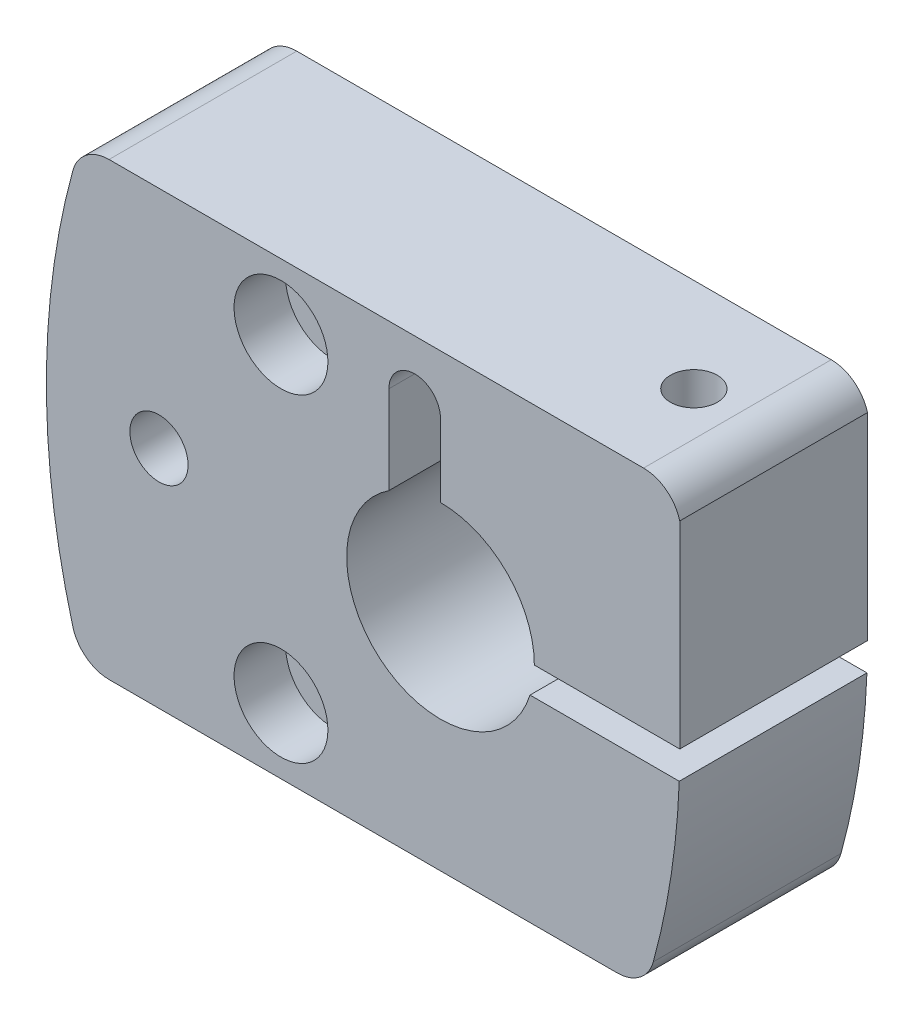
ISO-10303-21;
HEADER;
FILE_DESCRIPTION(('STEP AP214'),'2;1');
FILE_NAME('part.step','',(''),(''),'','','');
FILE_SCHEMA(('AUTOMOTIVE_DESIGN { 1 0 10303 214 1 1 1 1 }'));
ENDSEC;
DATA;
#1=APPLICATION_CONTEXT('core data for automotive mechanical design processes');
#2=APPLICATION_PROTOCOL_DEFINITION('international standard','automotive_design',2000,#1);
#3=PRODUCT_CONTEXT('',#1,'mechanical');
#4=PRODUCT('Part','Part','',(#3));
#5=PRODUCT_RELATED_PRODUCT_CATEGORY('part','',(#4));
#6=PRODUCT_DEFINITION_FORMATION('','',#4);
#7=PRODUCT_DEFINITION_CONTEXT('part definition',#1,'design');
#8=PRODUCT_DEFINITION('design','',#6,#7);
#9=PRODUCT_DEFINITION_SHAPE('','',#8);
#10=(LENGTH_UNIT() NAMED_UNIT(*) SI_UNIT(.MILLI.,.METRE.));
#11=(NAMED_UNIT(*) PLANE_ANGLE_UNIT() SI_UNIT($,.RADIAN.));
#12=(NAMED_UNIT(*) SI_UNIT($,.STERADIAN.) SOLID_ANGLE_UNIT());
#13=UNCERTAINTY_MEASURE_WITH_UNIT(LENGTH_MEASURE(1.E-05),#10,'distance_accuracy_value','');
#14=(GEOMETRIC_REPRESENTATION_CONTEXT(3) GLOBAL_UNCERTAINTY_ASSIGNED_CONTEXT((#13)) GLOBAL_UNIT_ASSIGNED_CONTEXT((#10,
#11,#12)) REPRESENTATION_CONTEXT('',''));
#15=CARTESIAN_POINT('',(0.,0.,0.));
#16=DIRECTION('',(0.,0.,1.));
#17=DIRECTION('',(1.,0.,0.));
#18=AXIS2_PLACEMENT_3D('',#15,#16,#17);
#19=CARTESIAN_POINT('',(19.5387056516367,-11.0000000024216,12.53));
#20=DIRECTION('',(1.23940943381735E-10,1.,0.));
#21=DIRECTION('',(0.,0.,-1.));
#22=AXIS2_PLACEMENT_3D('',#19,#20,#21);
#23=PLANE('',#22);
#24=CARTESIAN_POINT('',(16.9999999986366,-11.000000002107,10.));
#25=DIRECTION('',(1.23940943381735E-10,1.,0.));
#26=DIRECTION('',(0.,0.,-1.));
#27=AXIS2_PLACEMENT_3D('',#24,#25,#26);
#28=CIRCLE('',#27,2.5);
#29=CARTESIAN_POINT('',(16.9999999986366,-11.000000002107,7.5));
#30=VERTEX_POINT('',#29);
#31=EDGE_CURVE('E188',#30,#30,#28,.T.);
#32=ORIENTED_EDGE('',*,*,#31,.T.);
#33=EDGE_LOOP('',(#32));
#34=FACE_BOUND('',#33,.T.);
#35=ADVANCED_FACE('F14',(#34),#23,.T.);
#36=CARTESIAN_POINT('',(-16.999999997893,17.000000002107,14.5));
#37=DIRECTION('',(0.,0.,-1.));
#38=DIRECTION('',(-1.23940943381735E-10,-1.,0.));
#39=AXIS2_PLACEMENT_3D('',#36,#37,#38);
#40=CYLINDRICAL_SURFACE('',#39,2.75);
#41=CARTESIAN_POINT('',(-16.999999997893,17.000000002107,14.5));
#42=DIRECTION('',(0.,0.,-1.));
#43=DIRECTION('',(-1.23940943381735E-10,-1.,0.));
#44=AXIS2_PLACEMENT_3D('',#41,#42,#43);
#45=CIRCLE('',#44,2.75);
#46=CARTESIAN_POINT('',(-16.9999999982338,14.250000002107,14.5));
#47=VERTEX_POINT('',#46);
#48=EDGE_CURVE('E185',#47,#47,#45,.T.);
#49=ORIENTED_EDGE('',*,*,#48,.F.);
#50=EDGE_LOOP('',(#49));
#51=FACE_BOUND('',#50,.T.);
#52=CARTESIAN_POINT('',(-16.999999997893,17.000000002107,5.5));
#53=DIRECTION('',(0.,0.,-1.));
#54=DIRECTION('',(-1.23940943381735E-10,-1.,0.));
#55=AXIS2_PLACEMENT_3D('',#52,#53,#54);
#56=CIRCLE('',#55,2.75);
#57=CARTESIAN_POINT('',(-16.9999999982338,14.250000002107,5.5));
#58=VERTEX_POINT('',#57);
#59=EDGE_CURVE('E190',#58,#58,#56,.F.);
#60=ORIENTED_EDGE('',*,*,#59,.F.);
#61=EDGE_LOOP('',(#60));
#62=FACE_BOUND('',#61,.T.);
#63=ADVANCED_FACE('F202',(#51,#62),#40,.F.);
#64=CARTESIAN_POINT('',(-17.000000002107,-16.999999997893,14.5));
#65=DIRECTION('',(0.,0.,-1.));
#66=DIRECTION('',(-1.23940943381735E-10,-1.,0.));
#67=AXIS2_PLACEMENT_3D('',#64,#65,#66);
#68=CYLINDRICAL_SURFACE('',#67,2.75);
#69=CARTESIAN_POINT('',(-17.000000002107,-16.999999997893,14.5));
#70=DIRECTION('',(0.,0.,-1.));
#71=DIRECTION('',(-1.23940943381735E-10,-1.,0.));
#72=AXIS2_PLACEMENT_3D('',#69,#70,#71);
#73=CIRCLE('',#72,2.75);
#74=CARTESIAN_POINT('',(-17.0000000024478,-19.749999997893,14.5));
#75=VERTEX_POINT('',#74);
#76=EDGE_CURVE('E182',#75,#75,#73,.T.);
#77=ORIENTED_EDGE('',*,*,#76,.F.);
#78=EDGE_LOOP('',(#77));
#79=FACE_BOUND('',#78,.T.);
#80=CARTESIAN_POINT('',(-17.000000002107,-16.999999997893,5.5));
#81=DIRECTION('',(0.,0.,-1.));
#82=DIRECTION('',(-1.23940943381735E-10,-1.,0.));
#83=AXIS2_PLACEMENT_3D('',#80,#81,#82);
#84=CIRCLE('',#83,2.75);
#85=CARTESIAN_POINT('',(-17.0000000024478,-19.749999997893,5.5));
#86=VERTEX_POINT('',#85);
#87=EDGE_CURVE('E18',#86,#86,#84,.F.);
#88=ORIENTED_EDGE('',*,*,#87,.F.);
#89=EDGE_LOOP('',(#88));
#90=FACE_BOUND('',#89,.T.);
#91=ADVANCED_FACE('F200',(#79,#90),#68,.F.);
#92=CARTESIAN_POINT('',(-11.9225886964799,-11.9399999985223,5.5));
#93=DIRECTION('',(0.,0.,-1.));
#94=DIRECTION('',(-1.23940943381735E-10,-1.,0.));
#95=AXIS2_PLACEMENT_3D('',#92,#93,#94);
#96=PLANE('',#95);
#97=ORIENTED_EDGE('',*,*,#87,.T.);
#98=EDGE_LOOP('',(#97));
#99=FACE_BOUND('',#98,.T.);
#100=CARTESIAN_POINT('',(-17.000000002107,-16.999999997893,5.5));
#101=DIRECTION('',(0.,0.,-1.));
#102=DIRECTION('',(-1.23940943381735E-10,-1.,0.));
#103=AXIS2_PLACEMENT_3D('',#100,#101,#102);
#104=CIRCLE('',#103,5.);
#105=CARTESIAN_POINT('',(-17.0000000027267,-21.999999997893,5.5));
#106=VERTEX_POINT('',#105);
#107=EDGE_CURVE('E179',#106,#106,#104,.T.);
#108=ORIENTED_EDGE('',*,*,#107,.T.);
#109=EDGE_LOOP('',(#108));
#110=FACE_BOUND('',#109,.T.);
#111=ADVANCED_FACE('F197',(#99,#110),#96,.T.);
#112=CARTESIAN_POINT('',(-11.9225886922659,22.0600000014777,5.5));
#113=DIRECTION('',(0.,0.,-1.));
#114=DIRECTION('',(-1.23940943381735E-10,-1.,0.));
#115=AXIS2_PLACEMENT_3D('',#112,#113,#114);
#116=PLANE('',#115);
#117=ORIENTED_EDGE('',*,*,#59,.T.);
#118=EDGE_LOOP('',(#117));
#119=FACE_BOUND('',#118,.T.);
#120=CARTESIAN_POINT('',(-16.999999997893,17.000000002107,5.5));
#121=DIRECTION('',(0.,0.,-1.));
#122=DIRECTION('',(-1.23940943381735E-10,-1.,0.));
#123=AXIS2_PLACEMENT_3D('',#120,#121,#122);
#124=CIRCLE('',#123,5.);
#125=CARTESIAN_POINT('',(-16.9999999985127,12.000000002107,5.5));
#126=VERTEX_POINT('',#125);
#127=EDGE_CURVE('E176',#126,#126,#124,.T.);
#128=ORIENTED_EDGE('',*,*,#127,.T.);
#129=EDGE_LOOP('',(#128));
#130=FACE_BOUND('',#129,.T.);
#131=ADVANCED_FACE('F211',(#119,#130),#116,.T.);
#132=CARTESIAN_POINT('',(16.9999999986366,-11.000000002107,10.));
#133=DIRECTION('',(1.23940943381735E-10,1.,0.));
#134=DIRECTION('',(0.,0.,-1.));
#135=AXIS2_PLACEMENT_3D('',#132,#133,#134);
#136=CYLINDRICAL_SURFACE('',#135,2.5);
#137=CARTESIAN_POINT('',(16.9999999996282,-3.000000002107,10.));
#138=DIRECTION('',(1.23940943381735E-10,1.,0.));
#139=DIRECTION('',(0.,0.,-1.));
#140=AXIS2_PLACEMENT_3D('',#137,#138,#139);
#141=CIRCLE('',#140,2.5);
#142=CARTESIAN_POINT('',(16.9999999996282,-3.000000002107,7.5));
#143=VERTEX_POINT('',#142);
#144=EDGE_CURVE('E167',#143,#143,#141,.T.);
#145=ORIENTED_EDGE('',*,*,#144,.T.);
#146=EDGE_LOOP('',(#145));
#147=FACE_BOUND('',#146,.T.);
#148=ORIENTED_EDGE('',*,*,#31,.F.);
#149=EDGE_LOOP('',(#148));
#150=FACE_BOUND('',#149,.T.);
#151=ADVANCED_FACE('F235',(#147,#150),#136,.F.);
#152=CARTESIAN_POINT('',(17.,-2.10699860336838E-09,10.));
#153=DIRECTION('',(1.23940943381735E-10,1.,0.));
#154=DIRECTION('',(0.,0.,-1.));
#155=AXIS2_PLACEMENT_3D('',#152,#153,#154);
#156=CYLINDRICAL_SURFACE('',#155,2.5);
#157=CARTESIAN_POINT('',(17.,-2.10699860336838E-09,10.));
#158=DIRECTION('',(1.23940943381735E-10,1.,0.));
#159=DIRECTION('',(0.,0.,-1.));
#160=AXIS2_PLACEMENT_3D('',#157,#158,#159);
#161=CIRCLE('',#160,2.5);
#162=CARTESIAN_POINT('',(17.,-2.10699860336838E-09,7.5));
#163=VERTEX_POINT('',#162);
#164=EDGE_CURVE('E162',#163,#163,#161,.F.);
#165=ORIENTED_EDGE('',*,*,#164,.T.);
#166=EDGE_LOOP('',(#165));
#167=FACE_BOUND('',#166,.T.);
#168=CARTESIAN_POINT('',(17.0000000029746,23.999999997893,10.));
#169=DIRECTION('',(1.23940943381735E-10,1.,0.));
#170=DIRECTION('',(0.,0.,-1.));
#171=AXIS2_PLACEMENT_3D('',#168,#169,#170);
#172=CIRCLE('',#171,2.5);
#173=CARTESIAN_POINT('',(17.0000000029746,23.999999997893,7.5));
#174=VERTEX_POINT('',#173);
#175=EDGE_CURVE('E172',#174,#174,#172,.T.);
#176=ORIENTED_EDGE('',*,*,#175,.T.);
#177=EDGE_LOOP('',(#176));
#178=FACE_BOUND('',#177,.T.);
#179=ADVANCED_FACE('F240',(#167,#178),#156,.F.);
#180=CARTESIAN_POINT('',(-11.9225886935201,11.9400000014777,14.5));
#181=DIRECTION('',(0.,0.,1.));
#182=DIRECTION('',(1.23940943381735E-10,1.,0.));
#183=AXIS2_PLACEMENT_3D('',#180,#181,#182);
#184=PLANE('',#183);
#185=ORIENTED_EDGE('',*,*,#48,.T.);
#186=EDGE_LOOP('',(#185));
#187=FACE_BOUND('',#186,.T.);
#188=CARTESIAN_POINT('',(-16.999999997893,17.000000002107,14.5));
#189=DIRECTION('',(0.,0.,1.));
#190=DIRECTION('',(1.23940943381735E-10,1.,0.));
#191=AXIS2_PLACEMENT_3D('',#188,#189,#190);
#192=CIRCLE('',#191,5.);
#193=CARTESIAN_POINT('',(-16.9999999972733,22.000000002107,14.5));
#194=VERTEX_POINT('',#193);
#195=EDGE_CURVE('E158',#194,#194,#192,.T.);
#196=ORIENTED_EDGE('',*,*,#195,.T.);
#197=EDGE_LOOP('',(#196));
#198=FACE_BOUND('',#197,.T.);
#199=ADVANCED_FACE('F236',(#187,#198),#184,.T.);
#200=CARTESIAN_POINT('',(-11.9225886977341,-22.0599999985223,14.5));
#201=DIRECTION('',(0.,0.,1.));
#202=DIRECTION('',(1.23940943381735E-10,1.,0.));
#203=AXIS2_PLACEMENT_3D('',#200,#201,#202);
#204=PLANE('',#203);
#205=ORIENTED_EDGE('',*,*,#76,.T.);
#206=EDGE_LOOP('',(#205));
#207=FACE_BOUND('',#206,.T.);
#208=CARTESIAN_POINT('',(-17.000000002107,-16.999999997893,14.5));
#209=DIRECTION('',(0.,0.,1.));
#210=DIRECTION('',(1.23940943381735E-10,1.,0.));
#211=AXIS2_PLACEMENT_3D('',#208,#209,#210);
#212=CIRCLE('',#211,5.);
#213=CARTESIAN_POINT('',(-17.0000000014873,-11.999999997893,14.5));
#214=VERTEX_POINT('',#213);
#215=EDGE_CURVE('E155',#214,#214,#212,.T.);
#216=ORIENTED_EDGE('',*,*,#215,.T.);
#217=EDGE_LOOP('',(#216));
#218=FACE_BOUND('',#217,.T.);
#219=ADVANCED_FACE('F239',(#207,#218),#204,.T.);
#220=CARTESIAN_POINT('',(-17.000000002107,-16.999999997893,5.5));
#221=DIRECTION('',(0.,0.,-1.));
#222=DIRECTION('',(-1.23940943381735E-10,-1.,0.));
#223=AXIS2_PLACEMENT_3D('',#220,#221,#222);
#224=CYLINDRICAL_SURFACE('',#223,5.);
#225=ORIENTED_EDGE('',*,*,#107,.F.);
#226=EDGE_LOOP('',(#225));
#227=FACE_BOUND('',#226,.T.);
#228=CARTESIAN_POINT('',(-17.000000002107,-16.999999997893,0.));
#229=DIRECTION('',(0.,0.,-1.));
#230=DIRECTION('',(-1.23940943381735E-10,-1.,0.));
#231=AXIS2_PLACEMENT_3D('',#228,#229,#230);
#232=CIRCLE('',#231,5.);
#233=CARTESIAN_POINT('',(-17.0000000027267,-21.999999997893,0.));
#234=VERTEX_POINT('',#233);
#235=EDGE_CURVE('E295',#234,#234,#232,.T.);
#236=ORIENTED_EDGE('',*,*,#235,.T.);
#237=EDGE_LOOP('',(#236));
#238=FACE_BOUND('',#237,.T.);
#239=ADVANCED_FACE('F244',(#227,#238),#224,.F.);
#240=CARTESIAN_POINT('',(-16.999999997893,17.000000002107,5.5));
#241=DIRECTION('',(0.,0.,-1.));
#242=DIRECTION('',(-1.23940943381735E-10,-1.,0.));
#243=AXIS2_PLACEMENT_3D('',#240,#241,#242);
#244=CYLINDRICAL_SURFACE('',#243,5.);
#245=ORIENTED_EDGE('',*,*,#127,.F.);
#246=EDGE_LOOP('',(#245));
#247=FACE_BOUND('',#246,.T.);
#248=CARTESIAN_POINT('',(-16.999999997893,17.000000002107,0.));
#249=DIRECTION('',(0.,0.,-1.));
#250=DIRECTION('',(-1.23940943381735E-10,-1.,0.));
#251=AXIS2_PLACEMENT_3D('',#248,#249,#250);
#252=CIRCLE('',#251,5.);
#253=CARTESIAN_POINT('',(-16.9999999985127,12.000000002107,0.));
#254=VERTEX_POINT('',#253);
#255=EDGE_CURVE('E292',#254,#254,#252,.T.);
#256=ORIENTED_EDGE('',*,*,#255,.T.);
#257=EDGE_LOOP('',(#256));
#258=FACE_BOUND('',#257,.T.);
#259=ADVANCED_FACE('F584',(#247,#258),#244,.F.);
#260=CARTESIAN_POINT('',(21.6409888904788,19.9999999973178,20.));
#261=DIRECTION('',(0.,0.,-1.));
#262=DIRECTION('',(-1.23940943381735E-10,-1.,0.));
#263=AXIS2_PLACEMENT_3D('',#260,#261,#262);
#264=CYLINDRICAL_SURFACE('',#263,4.);
#265=CARTESIAN_POINT('',(21.6409888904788,19.9999999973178,20.));
#266=DIRECTION('',(0.,0.,-1.));
#267=DIRECTION('',(-1.23940943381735E-10,-1.,0.));
#268=AXIS2_PLACEMENT_3D('',#265,#266,#267);
#269=CIRCLE('',#268,4.);
#270=CARTESIAN_POINT('',(25.5000000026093,21.0526315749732,20.));
#271=VERTEX_POINT('',#270);
#272=CARTESIAN_POINT('',(21.6409888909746,23.9999999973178,20.));
#273=VERTEX_POINT('',#272);
#274=EDGE_CURVE('E357',#271,#273,#269,.F.);
#275=ORIENTED_EDGE('',*,*,#274,.F.);
#276=DIRECTION('',(0.,0.,-1.));
#277=VECTOR('',#276,1.);
#278=CARTESIAN_POINT('',(25.5000000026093,21.0526315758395,10.));
#279=LINE('',#278,#277);
#280=CARTESIAN_POINT('',(25.5000000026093,21.0526315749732,0.));
#281=VERTEX_POINT('',#280);
#282=EDGE_CURVE('E161',#271,#281,#279,.T.);
#283=ORIENTED_EDGE('',*,*,#282,.T.);
#284=CARTESIAN_POINT('',(21.6409888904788,19.9999999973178,0.));
#285=DIRECTION('',(0.,0.,-1.));
#286=DIRECTION('',(-1.23940943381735E-10,-1.,0.));
#287=AXIS2_PLACEMENT_3D('',#284,#285,#286);
#288=CIRCLE('',#287,4.);
#289=CARTESIAN_POINT('',(21.6409888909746,23.9999999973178,0.));
#290=VERTEX_POINT('',#289);
#291=EDGE_CURVE('E297',#281,#290,#288,.F.);
#292=ORIENTED_EDGE('',*,*,#291,.T.);
#293=DIRECTION('',(0.,0.,1.));
#294=VECTOR('',#293,1.);
#295=CARTESIAN_POINT('',(21.6409888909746,23.9999999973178,10.));
#296=LINE('',#295,#294);
#297=EDGE_CURVE('E175',#290,#273,#296,.T.);
#298=ORIENTED_EDGE('',*,*,#297,.T.);
#299=EDGE_LOOP('',(#275,#283,#292,#298));
#300=FACE_BOUND('',#299,.T.);
#301=ADVANCED_FACE('F249',(#300),#264,.T.);
#302=CARTESIAN_POINT('',(21.6409888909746,23.9999999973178,0.));
#303=DIRECTION('',(-1.23940943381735E-10,-1.,0.));
#304=DIRECTION('',(0.,0.,1.));
#305=AXIS2_PLACEMENT_3D('',#302,#303,#304);
#306=PLANE('',#305);
#307=ORIENTED_EDGE('',*,*,#175,.F.);
#308=EDGE_LOOP('',(#307));
#309=FACE_BOUND('',#308,.T.);
#310=DIRECTION('',(0.,0.,-1.));
#311=VECTOR('',#310,1.);
#312=CARTESIAN_POINT('',(-35.3212111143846,24.0000000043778,10.));
#313=LINE('',#312,#311);
#314=CARTESIAN_POINT('',(-35.321211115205,24.0000000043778,20.));
#315=VERTEX_POINT('',#314);
#316=CARTESIAN_POINT('',(-35.321211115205,24.0000000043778,0.));
#317=VERTEX_POINT('',#316);
#318=EDGE_CURVE('E123',#315,#317,#313,.T.);
#319=ORIENTED_EDGE('',*,*,#318,.F.);
#320=DIRECTION('',(-1.,1.23940943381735E-10,0.));
#321=VECTOR('',#320,1.);
#322=CARTESIAN_POINT('',(-8.80382733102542,24.0000000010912,20.));
#323=LINE('',#322,#321);
#324=EDGE_CURVE('E354',#273,#315,#323,.T.);
#325=ORIENTED_EDGE('',*,*,#324,.F.);
#326=ORIENTED_EDGE('',*,*,#297,.F.);
#327=DIRECTION('',(-1.,1.23940943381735E-10,0.));
#328=VECTOR('',#327,1.);
#329=CARTESIAN_POINT('',(-8.80382733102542,24.0000000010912,0.));
#330=LINE('',#329,#328);
#331=EDGE_CURVE('E149',#290,#317,#330,.T.);
#332=ORIENTED_EDGE('',*,*,#331,.T.);
#333=EDGE_LOOP('',(#319,#325,#326,#332));
#334=FACE_BOUND('',#333,.T.);
#335=ADVANCED_FACE('F246',(#309,#334),#306,.F.);
#336=CARTESIAN_POINT('',(-35.3212111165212,20.0000000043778,20.));
#337=DIRECTION('',(0.,0.,-1.));
#338=DIRECTION('',(-1.23940943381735E-10,-1.,0.));
#339=AXIS2_PLACEMENT_3D('',#336,#337,#338);
#340=CYLINDRICAL_SURFACE('',#339,4.);
#341=CARTESIAN_POINT('',(-35.3212111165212,20.0000000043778,20.));
#342=DIRECTION('',(0.,0.,-1.));
#343=DIRECTION('',(-1.23940943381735E-10,-1.,0.));
#344=AXIS2_PLACEMENT_3D('',#341,#342,#343);
#345=CIRCLE('',#344,4.);
#346=CARTESIAN_POINT('',(-39.1802222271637,21.0526315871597,20.));
#347=VERTEX_POINT('',#346);
#348=EDGE_CURVE('E356',#315,#347,#345,.F.);
#349=ORIENTED_EDGE('',*,*,#348,.F.);
#350=ORIENTED_EDGE('',*,*,#318,.T.);
#351=CARTESIAN_POINT('',(-35.3212111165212,20.0000000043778,0.));
#352=DIRECTION('',(0.,0.,-1.));
#353=DIRECTION('',(-1.23940943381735E-10,-1.,0.));
#354=AXIS2_PLACEMENT_3D('',#351,#352,#353);
#355=CIRCLE('',#354,4.);
#356=CARTESIAN_POINT('',(-39.1802222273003,21.0526315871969,0.));
#357=VERTEX_POINT('',#356);
#358=EDGE_CURVE('E142',#317,#357,#355,.F.);
#359=ORIENTED_EDGE('',*,*,#358,.T.);
#360=DIRECTION('',(0.,0.,-1.));
#361=VECTOR('',#360,1.);
#362=CARTESIAN_POINT('',(-39.180222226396,21.052631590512,10.));
#363=LINE('',#362,#361);
#364=EDGE_CURVE('E130',#347,#357,#363,.T.);
#365=ORIENTED_EDGE('',*,*,#364,.F.);
#366=EDGE_LOOP('',(#349,#350,#359,#365));
#367=FACE_BOUND('',#366,.T.);
#368=ADVANCED_FACE('F148',(#367),#340,.T.);
#369=CARTESIAN_POINT('',(38.,-4.70974995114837E-09,20.));
#370=DIRECTION('',(0.,0.,-1.));
#371=DIRECTION('',(-1.23940943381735E-10,-1.,0.));
#372=AXIS2_PLACEMENT_3D('',#369,#370,#371);
#373=CYLINDRICAL_SURFACE('',#372,80.);
#374=CARTESIAN_POINT('',(38.,-4.70974995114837E-09,20.));
#375=DIRECTION('',(0.,0.,-1.));
#376=DIRECTION('',(-1.23940943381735E-10,-1.,0.));
#377=AXIS2_PLACEMENT_3D('',#374,#375,#376);
#378=CIRCLE('',#377,80.);
#379=CARTESIAN_POINT('',(-39.1802222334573,-21.0526315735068,20.));
#380=VERTEX_POINT('',#379);
#381=EDGE_CURVE('E135',#347,#380,#378,.F.);
#382=ORIENTED_EDGE('',*,*,#381,.F.);
#383=ORIENTED_EDGE('',*,*,#364,.T.);
#384=CARTESIAN_POINT('',(38.,-4.70974995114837E-09,0.));
#385=DIRECTION('',(0.,0.,-1.));
#386=DIRECTION('',(-1.23940943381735E-10,-1.,0.));
#387=AXIS2_PLACEMENT_3D('',#384,#385,#386);
#388=CIRCLE('',#387,80.);
#389=CARTESIAN_POINT('',(-39.1802222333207,-21.0526315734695,0.));
#390=VERTEX_POINT('',#389);
#391=EDGE_CURVE('E134',#357,#390,#388,.F.);
#392=ORIENTED_EDGE('',*,*,#391,.T.);
#393=DIRECTION('',(0.,0.,-1.));
#394=VECTOR('',#393,1.);
#395=CARTESIAN_POINT('',(-39.1802222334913,-21.0526315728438,10.));
#396=LINE('',#395,#394);
#397=EDGE_CURVE('E136',#380,#390,#396,.T.);
#398=ORIENTED_EDGE('',*,*,#397,.F.);
#399=EDGE_LOOP('',(#382,#383,#392,#398));
#400=FACE_BOUND('',#399,.T.);
#401=ADVANCED_FACE('F132',(#400),#373,.T.);
#402=CARTESIAN_POINT('',(-35.3212111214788,-19.9999999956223,20.));
#403=DIRECTION('',(0.,0.,-1.));
#404=DIRECTION('',(-1.23940943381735E-10,-1.,0.));
#405=AXIS2_PLACEMENT_3D('',#402,#403,#404);
#406=CYLINDRICAL_SURFACE('',#405,4.);
#407=CARTESIAN_POINT('',(-35.3212111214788,-19.9999999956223,20.));
#408=DIRECTION('',(0.,0.,-1.));
#409=DIRECTION('',(-1.23940943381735E-10,-1.,0.));
#410=AXIS2_PLACEMENT_3D('',#407,#408,#409);
#411=CIRCLE('',#410,4.);
#412=CARTESIAN_POINT('',(-35.3212111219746,-23.9999999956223,20.));
#413=VERTEX_POINT('',#412);
#414=EDGE_CURVE('E353',#380,#413,#411,.F.);
#415=ORIENTED_EDGE('',*,*,#414,.F.);
#416=ORIENTED_EDGE('',*,*,#397,.T.);
#417=CARTESIAN_POINT('',(-35.3212111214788,-19.9999999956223,0.));
#418=DIRECTION('',(0.,0.,-1.));
#419=DIRECTION('',(-1.23940943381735E-10,-1.,0.));
#420=AXIS2_PLACEMENT_3D('',#417,#418,#419);
#421=CIRCLE('',#420,4.);
#422=CARTESIAN_POINT('',(-35.3212111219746,-23.9999999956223,0.));
#423=VERTEX_POINT('',#422);
#424=EDGE_CURVE('E146',#390,#423,#421,.F.);
#425=ORIENTED_EDGE('',*,*,#424,.T.);
#426=DIRECTION('',(0.,0.,1.));
#427=VECTOR('',#426,1.);
#428=CARTESIAN_POINT('',(-35.3212111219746,-23.9999999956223,10.));
#429=LINE('',#428,#427);
#430=EDGE_CURVE('E384',#423,#413,#429,.T.);
#431=ORIENTED_EDGE('',*,*,#430,.T.);
#432=EDGE_LOOP('',(#415,#416,#425,#431));
#433=FACE_BOUND('',#432,.T.);
#434=ADVANCED_FACE('F255',(#433),#406,.T.);
#435=CARTESIAN_POINT('',(18.8212111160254,-24.0000000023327,20.));
#436=DIRECTION('',(1.23940943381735E-10,1.,0.));
#437=DIRECTION('',(0.,0.,-1.));
#438=AXIS2_PLACEMENT_3D('',#435,#436,#437);
#439=PLANE('',#438);
#440=DIRECTION('',(0.,0.,-1.));
#441=VECTOR('',#440,1.);
#442=CARTESIAN_POINT('',(18.8212111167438,-24.0000000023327,10.));
#443=LINE('',#442,#441);
#444=CARTESIAN_POINT('',(18.8212111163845,-24.0000000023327,20.));
#445=VERTEX_POINT('',#444);
#446=CARTESIAN_POINT('',(18.8212111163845,-24.0000000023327,0.));
#447=VERTEX_POINT('',#446);
#448=EDGE_CURVE('E382',#445,#447,#443,.T.);
#449=ORIENTED_EDGE('',*,*,#448,.F.);
#450=DIRECTION('',(1.,-1.23940943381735E-10,0.));
#451=VECTOR('',#450,1.);
#452=CARTESIAN_POINT('',(-8.80382733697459,-23.9999999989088,20.));
#453=LINE('',#452,#451);
#454=EDGE_CURVE('E350',#413,#445,#453,.T.);
#455=ORIENTED_EDGE('',*,*,#454,.F.);
#456=ORIENTED_EDGE('',*,*,#430,.F.);
#457=DIRECTION('',(1.,-1.23940943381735E-10,0.));
#458=VECTOR('',#457,1.);
#459=CARTESIAN_POINT('',(-8.80382733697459,-23.9999999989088,0.));
#460=LINE('',#459,#458);
#461=EDGE_CURVE('E319',#423,#447,#460,.T.);
#462=ORIENTED_EDGE('',*,*,#461,.T.);
#463=EDGE_LOOP('',(#449,#455,#456,#462));
#464=FACE_BOUND('',#463,.T.);
#465=ADVANCED_FACE('F251',(#464),#439,.F.);
#466=CARTESIAN_POINT('',(18.8212111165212,-20.0000000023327,20.));
#467=DIRECTION('',(0.,0.,-1.));
#468=DIRECTION('',(-1.23940943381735E-10,-1.,0.));
#469=AXIS2_PLACEMENT_3D('',#466,#467,#468);
#470=CYLINDRICAL_SURFACE('',#469,4.);
#471=CARTESIAN_POINT('',(18.8212111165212,-20.0000000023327,20.));
#472=DIRECTION('',(0.,0.,-1.));
#473=DIRECTION('',(-1.23940943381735E-10,-1.,0.));
#474=AXIS2_PLACEMENT_3D('',#471,#472,#473);
#475=CIRCLE('',#474,4.);
#476=CARTESIAN_POINT('',(22.6802222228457,-21.0526316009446,20.));
#477=VERTEX_POINT('',#476);
#478=EDGE_CURVE('E352',#445,#477,#475,.F.);
#479=ORIENTED_EDGE('',*,*,#478,.F.);
#480=ORIENTED_EDGE('',*,*,#448,.T.);
#481=CARTESIAN_POINT('',(18.8212111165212,-20.0000000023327,0.));
#482=DIRECTION('',(0.,0.,-1.));
#483=DIRECTION('',(-1.23940943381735E-10,-1.,0.));
#484=AXIS2_PLACEMENT_3D('',#481,#482,#483);
#485=CIRCLE('',#484,4.);
#486=CARTESIAN_POINT('',(22.6802222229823,-21.0526316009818,0.));
#487=VERTEX_POINT('',#486);
#488=EDGE_CURVE('E317',#447,#487,#485,.F.);
#489=ORIENTED_EDGE('',*,*,#488,.T.);
#490=DIRECTION('',(0.,0.,-1.));
#491=VECTOR('',#490,1.);
#492=CARTESIAN_POINT('',(22.6802222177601,-21.0526316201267,10.));
#493=LINE('',#492,#491);
#494=EDGE_CURVE('E380',#477,#487,#493,.T.);
#495=ORIENTED_EDGE('',*,*,#494,.F.);
#496=EDGE_LOOP('',(#479,#480,#489,#495));
#497=FACE_BOUND('',#496,.T.);
#498=ADVANCED_FACE('F254',(#497),#470,.T.);
#499=CARTESIAN_POINT('',(-54.5,6.75480157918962E-09,20.));
#500=DIRECTION('',(0.,0.,-1.));
#501=DIRECTION('',(-1.23940943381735E-10,-1.,0.));
#502=AXIS2_PLACEMENT_3D('',#499,#500,#501);
#503=CYLINDRICAL_SURFACE('',#502,80.);
#504=CARTESIAN_POINT('',(-54.5,6.75480157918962E-09,20.));
#505=DIRECTION('',(0.,0.,-1.));
#506=DIRECTION('',(-1.23940943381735E-10,-1.,0.));
#507=AXIS2_PLACEMENT_3D('',#504,#505,#506);
#508=CIRCLE('',#507,80.);
#509=CARTESIAN_POINT('',(25.4437302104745,-3.0000000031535,20.));
#510=VERTEX_POINT('',#509);
#511=EDGE_CURVE('E349',#477,#510,#508,.F.);
#512=ORIENTED_EDGE('',*,*,#511,.F.);
#513=ORIENTED_EDGE('',*,*,#494,.T.);
#514=CARTESIAN_POINT('',(-54.5,6.75480157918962E-09,0.));
#515=DIRECTION('',(0.,0.,-1.));
#516=DIRECTION('',(-1.23940943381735E-10,-1.,0.));
#517=AXIS2_PLACEMENT_3D('',#514,#515,#516);
#518=CIRCLE('',#517,80.);
#519=CARTESIAN_POINT('',(25.4437302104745,-3.0000000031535,0.));
#520=VERTEX_POINT('',#519);
#521=EDGE_CURVE('E313',#487,#520,#518,.F.);
#522=ORIENTED_EDGE('',*,*,#521,.T.);
#523=DIRECTION('',(0.,0.,1.));
#524=VECTOR('',#523,1.);
#525=CARTESIAN_POINT('',(25.4437302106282,-3.0000000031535,10.));
#526=LINE('',#525,#524);
#527=EDGE_CURVE('E171',#520,#510,#526,.T.);
#528=ORIENTED_EDGE('',*,*,#527,.T.);
#529=EDGE_LOOP('',(#512,#513,#522,#528));
#530=FACE_BOUND('',#529,.T.);
#531=ADVANCED_FACE('F261',(#530),#503,.T.);
#532=CARTESIAN_POINT('',(9.53939201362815,-3.00000000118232,0.));
#533=DIRECTION('',(-1.23940943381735E-10,-1.,0.));
#534=DIRECTION('',(1.,-1.23940943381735E-10,0.));
#535=AXIS2_PLACEMENT_3D('',#532,#533,#534);
#536=PLANE('',#535);
#537=ORIENTED_EDGE('',*,*,#144,.F.);
#538=EDGE_LOOP('',(#537));
#539=FACE_BOUND('',#538,.T.);
#540=DIRECTION('',(0.,0.,1.));
#541=VECTOR('',#540,1.);
#542=CARTESIAN_POINT('',(9.53939201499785,-2.99999999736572,10.));
#543=LINE('',#542,#541);
#544=CARTESIAN_POINT('',(9.53939201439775,-2.99999999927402,0.));
#545=VERTEX_POINT('',#544);
#546=CARTESIAN_POINT('',(9.53939201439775,-2.99999999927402,20.));
#547=VERTEX_POINT('',#546);
#548=EDGE_CURVE('E375',#545,#547,#543,.T.);
#549=ORIENTED_EDGE('',*,*,#548,.T.);
#550=DIRECTION('',(-1.,1.23940943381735E-10,0.));
#551=VECTOR('',#550,1.);
#552=CARTESIAN_POINT('',(-8.80382733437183,-2.99999999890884,20.));
#553=LINE('',#552,#551);
#554=EDGE_CURVE('E346',#510,#547,#553,.T.);
#555=ORIENTED_EDGE('',*,*,#554,.F.);
#556=ORIENTED_EDGE('',*,*,#527,.F.);
#557=DIRECTION('',(-1.,1.23940943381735E-10,0.));
#558=VECTOR('',#557,1.);
#559=CARTESIAN_POINT('',(-8.80382733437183,-2.99999999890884,0.));
#560=LINE('',#559,#558);
#561=EDGE_CURVE('E316',#520,#545,#560,.T.);
#562=ORIENTED_EDGE('',*,*,#561,.T.);
#563=EDGE_LOOP('',(#549,#555,#556,#562));
#564=FACE_BOUND('',#563,.T.);
#565=ADVANCED_FACE('F257',(#539,#564),#536,.F.);
#566=CARTESIAN_POINT('',(-2.74999999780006,17.7500000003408,20.));
#567=DIRECTION('',(0.,0.,-1.));
#568=DIRECTION('',(-1.23940943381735E-10,-1.,0.));
#569=AXIS2_PLACEMENT_3D('',#566,#567,#568);
#570=CYLINDRICAL_SURFACE('',#569,2.75);
#571=DIRECTION('',(0.,0.,1.));
#572=VECTOR('',#571,1.);
#573=CARTESIAN_POINT('',(2.19995202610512E-09,17.75,10.));
#574=LINE('',#573,#572);
#575=CARTESIAN_POINT('',(8.99249771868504E-09,17.75,0.));
#576=VERTEX_POINT('',#575);
#577=CARTESIAN_POINT('',(8.99249771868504E-09,17.75,20.));
#578=VERTEX_POINT('',#577);
#579=EDGE_CURVE('E170',#576,#578,#574,.T.);
#580=ORIENTED_EDGE('',*,*,#579,.T.);
#581=CARTESIAN_POINT('',(-2.74999999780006,17.7500000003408,20.));
#582=DIRECTION('',(0.,0.,-1.));
#583=DIRECTION('',(-1.23940943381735E-10,-1.,0.));
#584=AXIS2_PLACEMENT_3D('',#581,#582,#583);
#585=CIRCLE('',#584,2.75);
#586=CARTESIAN_POINT('',(-5.49999999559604,17.7500000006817,20.));
#587=VERTEX_POINT('',#586);
#588=EDGE_CURVE('E342',#587,#578,#585,.T.);
#589=ORIENTED_EDGE('',*,*,#588,.F.);
#590=DIRECTION('',(0.,0.,-1.));
#591=VECTOR('',#590,1.);
#592=CARTESIAN_POINT('',(-5.49999999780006,17.7500000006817,10.));
#593=LINE('',#592,#591);
#594=CARTESIAN_POINT('',(-5.49999999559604,17.7500000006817,0.));
#595=VERTEX_POINT('',#594);
#596=EDGE_CURVE('E151',#587,#595,#593,.T.);
#597=ORIENTED_EDGE('',*,*,#596,.T.);
#598=CARTESIAN_POINT('',(-2.74999999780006,17.7500000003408,0.));
#599=DIRECTION('',(0.,0.,-1.));
#600=DIRECTION('',(-1.23940943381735E-10,-1.,0.));
#601=AXIS2_PLACEMENT_3D('',#598,#599,#600);
#602=CIRCLE('',#601,2.75);
#603=EDGE_CURVE('E310',#595,#576,#602,.T.);
#604=ORIENTED_EDGE('',*,*,#603,.T.);
#605=EDGE_LOOP('',(#580,#589,#597,#604));
#606=FACE_BOUND('',#605,.T.);
#607=ADVANCED_FACE('F260',(#606),#570,.F.);
#608=CARTESIAN_POINT('',(1.23940094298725E-09,10.,20.));
#609=DIRECTION('',(1.,-1.23940943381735E-10,0.));
#610=DIRECTION('',(0.,0.,-1.));
#611=AXIS2_PLACEMENT_3D('',#608,#609,#610);
#612=PLANE('',#611);
#613=DIRECTION('',(0.,0.,1.));
#614=VECTOR('',#613,1.);
#615=CARTESIAN_POINT('',(5.34145297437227E-09,10.,10.));
#616=LINE('',#615,#614);
#617=CARTESIAN_POINT('',(1.00830004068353E-08,10.,0.));
#618=VERTEX_POINT('',#617);
#619=CARTESIAN_POINT('',(1.00830004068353E-08,10.,20.));
#620=VERTEX_POINT('',#619);
#621=EDGE_CURVE('E369',#618,#620,#616,.T.);
#622=ORIENTED_EDGE('',*,*,#621,.T.);
#623=DIRECTION('',(-1.23940943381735E-10,-1.,0.));
#624=VECTOR('',#623,1.);
#625=CARTESIAN_POINT('',(1.3585150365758E-08,0.,20.));
#626=LINE('',#625,#624);
#627=EDGE_CURVE('E340',#578,#620,#626,.T.);
#628=ORIENTED_EDGE('',*,*,#627,.F.);
#629=ORIENTED_EDGE('',*,*,#579,.F.);
#630=DIRECTION('',(-1.23940943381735E-10,-1.,0.));
#631=VECTOR('',#630,1.);
#632=CARTESIAN_POINT('',(1.3585150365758E-08,0.,0.));
#633=LINE('',#632,#631);
#634=EDGE_CURVE('E309',#576,#618,#633,.T.);
#635=ORIENTED_EDGE('',*,*,#634,.T.);
#636=EDGE_LOOP('',(#622,#628,#629,#635));
#637=FACE_BOUND('',#636,.T.);
#638=ADVANCED_FACE('F263',(#637),#612,.F.);
#639=CARTESIAN_POINT('',(0.,0.,20.));
#640=DIRECTION('',(0.,0.,-1.));
#641=DIRECTION('',(-1.23940943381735E-10,-1.,0.));
#642=AXIS2_PLACEMENT_3D('',#639,#640,#641);
#643=CYLINDRICAL_SURFACE('',#642,10.);
#644=DIRECTION('',(0.,0.,1.));
#645=VECTOR('',#644,1.);
#646=CARTESIAN_POINT('',(10.,-1.23939747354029E-09,10.));
#647=LINE('',#646,#645);
#648=CARTESIAN_POINT('',(10.,-1.23939747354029E-09,0.));
#649=VERTEX_POINT('',#648);
#650=CARTESIAN_POINT('',(10.,-1.23939747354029E-09,20.));
#651=VERTEX_POINT('',#650);
#652=EDGE_CURVE('E166',#649,#651,#647,.T.);
#653=ORIENTED_EDGE('',*,*,#652,.T.);
#654=CARTESIAN_POINT('',(0.,0.,20.));
#655=DIRECTION('',(0.,0.,-1.));
#656=DIRECTION('',(-1.23940943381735E-10,-1.,0.));
#657=AXIS2_PLACEMENT_3D('',#654,#655,#656);
#658=CIRCLE('',#657,10.);
#659=EDGE_CURVE('E337',#620,#651,#658,.T.);
#660=ORIENTED_EDGE('',*,*,#659,.F.);
#661=ORIENTED_EDGE('',*,*,#621,.F.);
#662=CARTESIAN_POINT('',(0.,0.,0.));
#663=DIRECTION('',(0.,0.,-1.));
#664=DIRECTION('',(-1.23940943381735E-10,-1.,0.));
#665=AXIS2_PLACEMENT_3D('',#662,#663,#664);
#666=CIRCLE('',#665,10.);
#667=EDGE_CURVE('E305',#618,#649,#666,.T.);
#668=ORIENTED_EDGE('',*,*,#667,.T.);
#669=EDGE_LOOP('',(#653,#660,#661,#668));
#670=FACE_BOUND('',#669,.T.);
#671=ADVANCED_FACE('F266',(#670),#643,.F.);
#672=CARTESIAN_POINT('',(25.5,-3.16049963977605E-09,0.));
#673=DIRECTION('',(1.23940943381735E-10,1.,0.));
#674=DIRECTION('',(-1.,1.23940943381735E-10,0.));
#675=AXIS2_PLACEMENT_3D('',#672,#673,#674);
#676=PLANE('',#675);
#677=ORIENTED_EDGE('',*,*,#164,.F.);
#678=EDGE_LOOP('',(#677));
#679=FACE_BOUND('',#678,.T.);
#680=DIRECTION('',(0.,0.,1.));
#681=VECTOR('',#680,1.);
#682=CARTESIAN_POINT('',(25.5,-3.16049963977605E-09,10.));
#683=LINE('',#682,#681);
#684=CARTESIAN_POINT('',(25.5,-3.16049963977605E-09,0.));
#685=VERTEX_POINT('',#684);
#686=CARTESIAN_POINT('',(25.5,-3.16049963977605E-09,20.));
#687=VERTEX_POINT('',#686);
#688=EDGE_CURVE('E165',#685,#687,#683,.T.);
#689=ORIENTED_EDGE('',*,*,#688,.T.);
#690=DIRECTION('',(1.,-1.23940943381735E-10,0.));
#691=VECTOR('',#690,1.);
#692=CARTESIAN_POINT('',(-8.803827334,1.09115147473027E-09,20.));
#693=LINE('',#692,#691);
#694=EDGE_CURVE('E332',#651,#687,#693,.T.);
#695=ORIENTED_EDGE('',*,*,#694,.F.);
#696=ORIENTED_EDGE('',*,*,#652,.F.);
#697=DIRECTION('',(1.,-1.23940943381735E-10,0.));
#698=VECTOR('',#697,1.);
#699=CARTESIAN_POINT('',(-8.803827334,1.09115147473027E-09,0.));
#700=LINE('',#699,#698);
#701=EDGE_CURVE('E308',#649,#685,#700,.T.);
#702=ORIENTED_EDGE('',*,*,#701,.T.);
#703=EDGE_LOOP('',(#689,#695,#696,#702));
#704=FACE_BOUND('',#703,.T.);
#705=ADVANCED_FACE('F268',(#679,#704),#676,.F.);
#706=CARTESIAN_POINT('',(25.5000000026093,21.0526315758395,0.));
#707=DIRECTION('',(-1.,1.23940943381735E-10,0.));
#708=DIRECTION('',(-1.23940943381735E-10,-1.,0.));
#709=AXIS2_PLACEMENT_3D('',#706,#707,#708);
#710=PLANE('',#709);
#711=ORIENTED_EDGE('',*,*,#282,.F.);
#712=DIRECTION('',(1.23940943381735E-10,1.,0.));
#713=VECTOR('',#712,1.);
#714=CARTESIAN_POINT('',(25.5,-3.16049963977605E-09,20.));
#715=LINE('',#714,#713);
#716=EDGE_CURVE('E328',#687,#271,#715,.T.);
#717=ORIENTED_EDGE('',*,*,#716,.F.);
#718=ORIENTED_EDGE('',*,*,#688,.F.);
#719=DIRECTION('',(1.23940943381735E-10,1.,0.));
#720=VECTOR('',#719,1.);
#721=CARTESIAN_POINT('',(25.5,-3.16049963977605E-09,0.));
#722=LINE('',#721,#720);
#723=EDGE_CURVE('E301',#685,#281,#722,.T.);
#724=ORIENTED_EDGE('',*,*,#723,.T.);
#725=EDGE_LOOP('',(#711,#717,#718,#724));
#726=FACE_BOUND('',#725,.T.);
#727=ADVANCED_FACE('F271',(#726),#710,.F.);
#728=CARTESIAN_POINT('',(-16.999999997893,17.000000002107,14.5));
#729=DIRECTION('',(0.,0.,1.));
#730=DIRECTION('',(1.23940943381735E-10,1.,0.));
#731=AXIS2_PLACEMENT_3D('',#728,#729,#730);
#732=CYLINDRICAL_SURFACE('',#731,5.);
#733=CARTESIAN_POINT('',(-16.999999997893,17.000000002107,20.));
#734=DIRECTION('',(0.,0.,1.));
#735=DIRECTION('',(1.23940943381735E-10,1.,0.));
#736=AXIS2_PLACEMENT_3D('',#733,#734,#735);
#737=CIRCLE('',#736,5.);
#738=CARTESIAN_POINT('',(-16.9999999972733,22.000000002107,20.));
#739=VERTEX_POINT('',#738);
#740=EDGE_CURVE('E331',#739,#739,#737,.F.);
#741=ORIENTED_EDGE('',*,*,#740,.F.);
#742=EDGE_LOOP('',(#741));
#743=FACE_BOUND('',#742,.T.);
#744=ORIENTED_EDGE('',*,*,#195,.F.);
#745=EDGE_LOOP('',(#744));
#746=FACE_BOUND('',#745,.T.);
#747=ADVANCED_FACE('F275',(#743,#746),#732,.F.);
#748=CARTESIAN_POINT('',(-17.000000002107,-16.999999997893,14.5));
#749=DIRECTION('',(0.,0.,1.));
#750=DIRECTION('',(1.23940943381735E-10,1.,0.));
#751=AXIS2_PLACEMENT_3D('',#748,#749,#750);
#752=CYLINDRICAL_SURFACE('',#751,5.);
#753=CARTESIAN_POINT('',(-17.000000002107,-16.999999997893,20.));
#754=DIRECTION('',(0.,0.,1.));
#755=DIRECTION('',(1.23940943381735E-10,1.,0.));
#756=AXIS2_PLACEMENT_3D('',#753,#754,#755);
#757=CIRCLE('',#756,5.);
#758=CARTESIAN_POINT('',(-17.0000000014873,-11.999999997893,20.));
#759=VERTEX_POINT('',#758);
#760=EDGE_CURVE('E393',#759,#759,#757,.F.);
#761=ORIENTED_EDGE('',*,*,#760,.F.);
#762=EDGE_LOOP('',(#761));
#763=FACE_BOUND('',#762,.T.);
#764=ORIENTED_EDGE('',*,*,#215,.F.);
#765=EDGE_LOOP('',(#764));
#766=FACE_BOUND('',#765,.T.);
#767=ADVANCED_FACE('F407',(#763,#766),#752,.F.);
#768=CARTESIAN_POINT('',(-30.,3.71825140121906E-09,20.));
#769=DIRECTION('',(0.,0.,-1.));
#770=DIRECTION('',(-1.23940943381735E-10,-1.,0.));
#771=AXIS2_PLACEMENT_3D('',#768,#769,#770);
#772=CYLINDRICAL_SURFACE('',#771,3.1);
#773=CARTESIAN_POINT('',(-30.,3.71825140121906E-09,20.));
#774=DIRECTION('',(0.,0.,-1.));
#775=DIRECTION('',(-1.23940943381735E-10,-1.,0.));
#776=AXIS2_PLACEMENT_3D('',#773,#774,#775);
#777=CIRCLE('',#776,3.1);
#778=CARTESIAN_POINT('',(-30.0000000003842,-3.09999999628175,20.));
#779=VERTEX_POINT('',#778);
#780=EDGE_CURVE('E361',#779,#779,#777,.T.);
#781=ORIENTED_EDGE('',*,*,#780,.F.);
#782=EDGE_LOOP('',(#781));
#783=FACE_BOUND('',#782,.T.);
#784=CARTESIAN_POINT('',(-30.,3.71825140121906E-09,0.));
#785=DIRECTION('',(0.,0.,-1.));
#786=DIRECTION('',(-1.23940943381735E-10,-1.,0.));
#787=AXIS2_PLACEMENT_3D('',#784,#785,#786);
#788=CIRCLE('',#787,3.1);
#789=CARTESIAN_POINT('',(-30.0000000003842,-3.09999999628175,0.));
#790=VERTEX_POINT('',#789);
#791=EDGE_CURVE('E288',#790,#790,#788,.T.);
#792=ORIENTED_EDGE('',*,*,#791,.T.);
#793=EDGE_LOOP('',(#792));
#794=FACE_BOUND('',#793,.T.);
#795=ADVANCED_FACE('F228',(#783,#794),#772,.F.);
#796=CARTESIAN_POINT('',(-5.4999999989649,8.3516465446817,0.));
#797=DIRECTION('',(-1.,1.23940943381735E-10,0.));
#798=DIRECTION('',(0.,0.,1.));
#799=AXIS2_PLACEMENT_3D('',#796,#797,#798);
#800=PLANE('',#799);
#801=ORIENTED_EDGE('',*,*,#596,.F.);
#802=DIRECTION('',(1.23940943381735E-10,1.,0.));
#803=VECTOR('',#802,1.);
#804=CARTESIAN_POINT('',(-5.49999999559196,6.8170122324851E-10,20.));
#805=LINE('',#804,#803);
#806=CARTESIAN_POINT('',(-5.49999999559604,8.3516465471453,20.));
#807=VERTEX_POINT('',#806);
#808=EDGE_CURVE('E343',#807,#587,#805,.T.);
#809=ORIENTED_EDGE('',*,*,#808,.F.);
#810=DIRECTION('',(0.,0.,-1.));
#811=VECTOR('',#810,1.);
#812=CARTESIAN_POINT('',(-5.4999999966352,8.35164654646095,10.));
#813=LINE('',#812,#811);
#814=CARTESIAN_POINT('',(-5.49999999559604,8.3516465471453,0.));
#815=VERTEX_POINT('',#814);
#816=EDGE_CURVE('E358',#807,#815,#813,.T.);
#817=ORIENTED_EDGE('',*,*,#816,.T.);
#818=DIRECTION('',(1.23940943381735E-10,1.,0.));
#819=VECTOR('',#818,1.);
#820=CARTESIAN_POINT('',(-5.49999999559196,6.8170122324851E-10,0.));
#821=LINE('',#820,#819);
#822=EDGE_CURVE('E33',#815,#595,#821,.T.);
#823=ORIENTED_EDGE('',*,*,#822,.T.);
#824=EDGE_LOOP('',(#801,#809,#817,#823));
#825=FACE_BOUND('',#824,.T.);
#826=ADVANCED_FACE('F277',(#825),#800,.F.);
#827=CARTESIAN_POINT('',(25.4999999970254,-24.0000000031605,0.));
#828=DIRECTION('',(0.,0.,1.));
#829=DIRECTION('',(1.23940943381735E-10,1.,0.));
#830=AXIS2_PLACEMENT_3D('',#827,#828,#829);
#831=PLANE('',#830);
#832=ORIENTED_EDGE('',*,*,#791,.F.);
#833=EDGE_LOOP('',(#832));
#834=FACE_BOUND('',#833,.T.);
#835=ORIENTED_EDGE('',*,*,#255,.F.);
#836=EDGE_LOOP('',(#835));
#837=FACE_BOUND('',#836,.T.);
#838=ORIENTED_EDGE('',*,*,#235,.F.);
#839=EDGE_LOOP('',(#838));
#840=FACE_BOUND('',#839,.T.);
#841=ORIENTED_EDGE('',*,*,#723,.F.);
#842=ORIENTED_EDGE('',*,*,#701,.F.);
#843=ORIENTED_EDGE('',*,*,#667,.F.);
#844=ORIENTED_EDGE('',*,*,#634,.F.);
#845=ORIENTED_EDGE('',*,*,#603,.F.);
#846=ORIENTED_EDGE('',*,*,#822,.F.);
#847=CARTESIAN_POINT('',(0.,0.,0.));
#848=DIRECTION('',(0.,0.,-1.));
#849=DIRECTION('',(-1.23940943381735E-10,-1.,0.));
#850=AXIS2_PLACEMENT_3D('',#847,#848,#849);
#851=CIRCLE('',#850,10.);
#852=EDGE_CURVE('E24',#815,#545,#851,.F.);
#853=ORIENTED_EDGE('',*,*,#852,.T.);
#854=ORIENTED_EDGE('',*,*,#561,.F.);
#855=ORIENTED_EDGE('',*,*,#521,.F.);
#856=ORIENTED_EDGE('',*,*,#488,.F.);
#857=ORIENTED_EDGE('',*,*,#461,.F.);
#858=ORIENTED_EDGE('',*,*,#424,.F.);
#859=ORIENTED_EDGE('',*,*,#391,.F.);
#860=ORIENTED_EDGE('',*,*,#358,.F.);
#861=ORIENTED_EDGE('',*,*,#331,.F.);
#862=ORIENTED_EDGE('',*,*,#291,.F.);
#863=EDGE_LOOP('',(#841,#842,#843,#844,#845,#846,#853,#854,#855,#856,#857,#858,#859,#860,#861,#862));
#864=FACE_BOUND('',#863,.T.);
#865=ADVANCED_FACE('F140',(#834,#837,#840,#864),#831,.F.);
#866=CARTESIAN_POINT('',(25.4999999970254,-24.0000000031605,20.));
#867=DIRECTION('',(0.,0.,1.));
#868=DIRECTION('',(1.23940943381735E-10,1.,0.));
#869=AXIS2_PLACEMENT_3D('',#866,#867,#868);
#870=PLANE('',#869);
#871=ORIENTED_EDGE('',*,*,#780,.T.);
#872=EDGE_LOOP('',(#871));
#873=FACE_BOUND('',#872,.T.);
#874=ORIENTED_EDGE('',*,*,#760,.T.);
#875=EDGE_LOOP('',(#874));
#876=FACE_BOUND('',#875,.T.);
#877=ORIENTED_EDGE('',*,*,#740,.T.);
#878=EDGE_LOOP('',(#877));
#879=FACE_BOUND('',#878,.T.);
#880=ORIENTED_EDGE('',*,*,#694,.T.);
#881=ORIENTED_EDGE('',*,*,#716,.T.);
#882=ORIENTED_EDGE('',*,*,#274,.T.);
#883=ORIENTED_EDGE('',*,*,#324,.T.);
#884=ORIENTED_EDGE('',*,*,#348,.T.);
#885=ORIENTED_EDGE('',*,*,#381,.T.);
#886=ORIENTED_EDGE('',*,*,#414,.T.);
#887=ORIENTED_EDGE('',*,*,#454,.T.);
#888=ORIENTED_EDGE('',*,*,#478,.T.);
#889=ORIENTED_EDGE('',*,*,#511,.T.);
#890=ORIENTED_EDGE('',*,*,#554,.T.);
#891=CARTESIAN_POINT('',(0.,0.,20.));
#892=DIRECTION('',(0.,0.,-1.));
#893=DIRECTION('',(-1.23940943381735E-10,-1.,0.));
#894=AXIS2_PLACEMENT_3D('',#891,#892,#893);
#895=CIRCLE('',#894,10.);
#896=EDGE_CURVE('E9',#547,#807,#895,.T.);
#897=ORIENTED_EDGE('',*,*,#896,.T.);
#898=ORIENTED_EDGE('',*,*,#808,.T.);
#899=ORIENTED_EDGE('',*,*,#588,.T.);
#900=ORIENTED_EDGE('',*,*,#627,.T.);
#901=ORIENTED_EDGE('',*,*,#659,.T.);
#902=EDGE_LOOP('',(#880,#881,#882,#883,#884,#885,#886,#887,#888,#889,#890,#897,#898,#899,#900,#901));
#903=FACE_BOUND('',#902,.T.);
#904=ADVANCED_FACE('F16',(#873,#876,#879,#903),#870,.T.);
#905=CARTESIAN_POINT('',(0.,0.,20.));
#906=DIRECTION('',(0.,0.,-1.));
#907=DIRECTION('',(-1.23940943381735E-10,-1.,0.));
#908=AXIS2_PLACEMENT_3D('',#905,#906,#907);
#909=CYLINDRICAL_SURFACE('',#908,10.);
#910=ORIENTED_EDGE('',*,*,#896,.F.);
#911=ORIENTED_EDGE('',*,*,#548,.F.);
#912=ORIENTED_EDGE('',*,*,#852,.F.);
#913=ORIENTED_EDGE('',*,*,#816,.F.);
#914=EDGE_LOOP('',(#910,#911,#912,#913));
#915=FACE_BOUND('',#914,.T.);
#916=ADVANCED_FACE('F217',(#915),#909,.F.);
#917=CLOSED_SHELL('',(#35,#63,#91,#111,#131,#151,#179,#199,#219,#239,#259,#301,#335,#368,#401,
#434,#465,#498,#531,#565,#607,#638,#671,#705,#727,#747,#767,#795,#826,#865,#904,#916));
#918=MANIFOLD_SOLID_BREP('B1',#917);
#919=ADVANCED_BREP_SHAPE_REPRESENTATION('',(#18,#918),#14);
#920=SHAPE_DEFINITION_REPRESENTATION(#9,#919);
ENDSEC;
END-ISO-10303-21;
